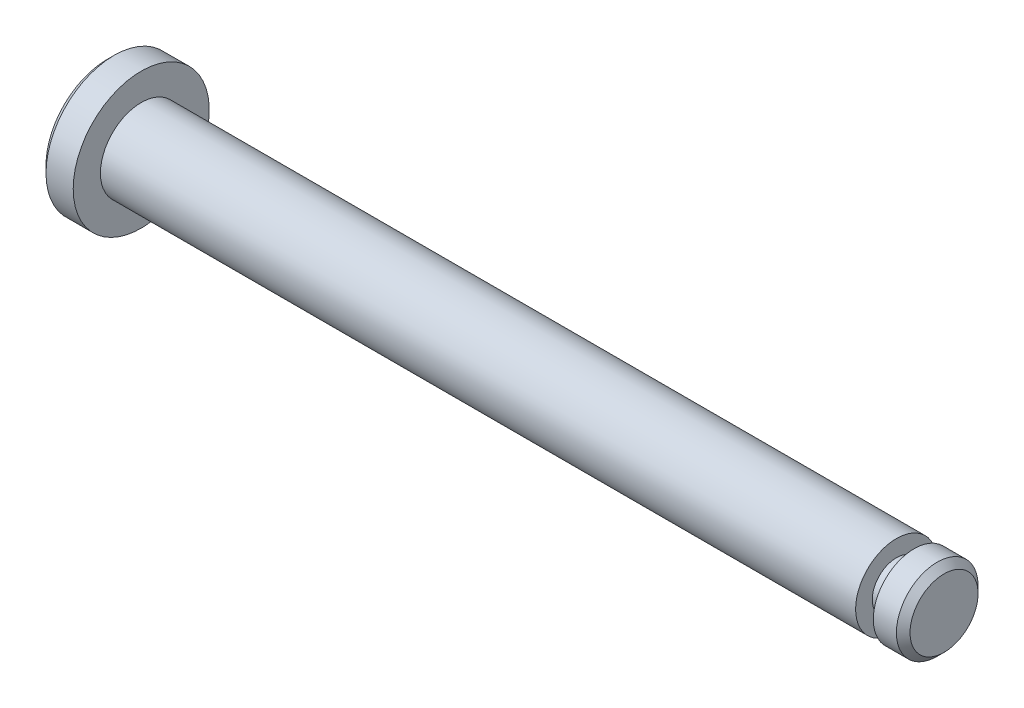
from build123d import *

# Parameters (mm, degrees)
CHANFREIN1_SIZE = 1
CHANFREIN2_SIZE = 1


with BuildPart() as part:
    # Esquisse1 → R_volution1 (revolve)
    with BuildSketch(Plane.XY, mode=Mode.PRIVATE) as r_volution1_sk:
        Polygon((-35.717111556, 0), (-35.717111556, 10), (-30.717111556, 10), (-30.717111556, 6), (80.282888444, 6), (80.282888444, 3.552574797), (82.883277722, 3.552574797), (82.883277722, 6), (87.282888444, 6), (87.282888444, 0), align=None)
    revolve(r_volution1_sk.sketch.rotate(Axis((-49.636842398, 0, 0), (1, 0, 0)), 90), axis=Axis((-49.636842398, 0, 0), (1, 0, 0)))

    # Chanfrein1
    chanfrein1_edges = [part.edges().sort_by_distance(p)[0] for p in [
        (87.282888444, 0, -6),
    ]]
    chamfer(chanfrein1_edges, length=CHANFREIN1_SIZE)

    # Chanfrein2
    chanfrein2_edges = [part.edges().sort_by_distance(p)[0] for p in [
        (-35.717111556, 0, -10),
    ]]
    chamfer(chanfrein2_edges, length=CHANFREIN2_SIZE)


solid = part.part
